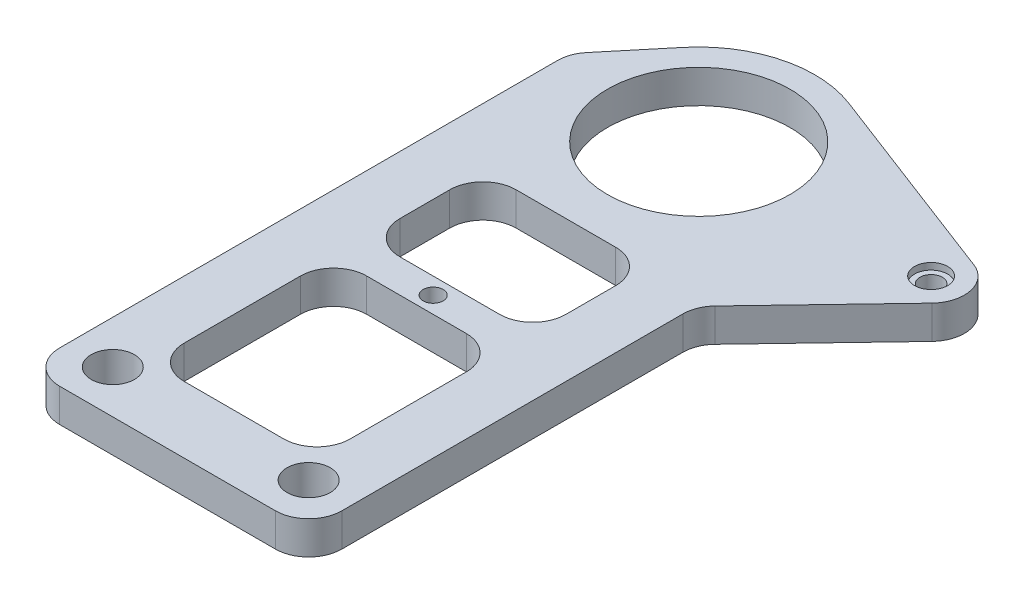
ISO-10303-21;
HEADER;
FILE_DESCRIPTION(('STEP AP214'),'2;1');
FILE_NAME('part.step','',(''),(''),'','','');
FILE_SCHEMA(('AUTOMOTIVE_DESIGN { 1 0 10303 214 1 1 1 1 }'));
ENDSEC;
DATA;
#1=APPLICATION_CONTEXT('core data for automotive mechanical design processes');
#2=APPLICATION_PROTOCOL_DEFINITION('international standard','automotive_design',2000,#1);
#3=PRODUCT_CONTEXT('',#1,'mechanical');
#4=PRODUCT('Part','Part','',(#3));
#5=PRODUCT_RELATED_PRODUCT_CATEGORY('part','',(#4));
#6=PRODUCT_DEFINITION_FORMATION('','',#4);
#7=PRODUCT_DEFINITION_CONTEXT('part definition',#1,'design');
#8=PRODUCT_DEFINITION('design','',#6,#7);
#9=PRODUCT_DEFINITION_SHAPE('','',#8);
#10=(LENGTH_UNIT() NAMED_UNIT(*) SI_UNIT(.MILLI.,.METRE.));
#11=(NAMED_UNIT(*) PLANE_ANGLE_UNIT() SI_UNIT($,.RADIAN.));
#12=(NAMED_UNIT(*) SI_UNIT($,.STERADIAN.) SOLID_ANGLE_UNIT());
#13=UNCERTAINTY_MEASURE_WITH_UNIT(LENGTH_MEASURE(1.E-05),#10,'distance_accuracy_value','');
#14=(GEOMETRIC_REPRESENTATION_CONTEXT(3) GLOBAL_UNCERTAINTY_ASSIGNED_CONTEXT((#13)) GLOBAL_UNIT_ASSIGNED_CONTEXT((#10,
#11,#12)) REPRESENTATION_CONTEXT('',''));
#15=CARTESIAN_POINT('',(0.,0.,0.));
#16=DIRECTION('',(0.,0.,1.));
#17=DIRECTION('',(1.,0.,0.));
#18=AXIS2_PLACEMENT_3D('',#15,#16,#17);
#19=CARTESIAN_POINT('',(-32.5,10.,150.));
#20=DIRECTION('',(0.,-1.,0.));
#21=DIRECTION('',(0.,0.,-1.));
#22=AXIS2_PLACEMENT_3D('',#19,#20,#21);
#23=PLANE('',#22);
#24=CARTESIAN_POINT('',(70.,10.,0.));
#25=DIRECTION('',(0.,1.,0.));
#26=DIRECTION('',(0.,0.,1.));
#27=AXIS2_PLACEMENT_3D('',#24,#25,#26);
#28=CIRCLE('',#27,5.);
#29=CARTESIAN_POINT('',(70.,10.,5.));
#30=VERTEX_POINT('',#29);
#31=EDGE_CURVE('E694',#30,#30,#28,.T.);
#32=ORIENTED_EDGE('',*,*,#31,.F.);
#33=EDGE_LOOP('',(#32));
#34=FACE_BOUND('',#33,.T.);
#35=CARTESIAN_POINT('',(29.4999999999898,10.,147.));
#36=DIRECTION('',(0.,1.,0.));
#37=DIRECTION('',(0.,0.,1.));
#38=AXIS2_PLACEMENT_3D('',#35,#36,#37);
#39=CIRCLE('',#38,6.50000000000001);
#40=CARTESIAN_POINT('',(29.4999999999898,10.,153.5));
#41=VERTEX_POINT('',#40);
#42=EDGE_CURVE('E513',#41,#41,#39,.T.);
#43=ORIENTED_EDGE('',*,*,#42,.F.);
#44=EDGE_LOOP('',(#43));
#45=FACE_BOUND('',#44,.T.);
#46=CARTESIAN_POINT('',(0.,10.,0.));
#47=DIRECTION('',(0.,1.,0.));
#48=DIRECTION('',(0.,0.,1.));
#49=AXIS2_PLACEMENT_3D('',#46,#47,#48);
#50=CIRCLE('',#49,27.5);
#51=CARTESIAN_POINT('',(0.,10.,27.5));
#52=VERTEX_POINT('',#51);
#53=EDGE_CURVE('E236',#52,#52,#50,.T.);
#54=ORIENTED_EDGE('',*,*,#53,.F.);
#55=EDGE_LOOP('',(#54));
#56=FACE_BOUND('',#55,.T.);
#57=CARTESIAN_POINT('',(-15.,10.,95.));
#58=DIRECTION('',(0.,1.,0.));
#59=DIRECTION('',(0.,0.,1.));
#60=AXIS2_PLACEMENT_3D('',#57,#58,#59);
#61=CIRCLE('',#60,9.99999999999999);
#62=CARTESIAN_POINT('',(-15.,10.,85.));
#63=VERTEX_POINT('',#62);
#64=CARTESIAN_POINT('',(-25.,10.,95.));
#65=VERTEX_POINT('',#64);
#66=EDGE_CURVE('E215',#63,#65,#61,.T.);
#67=ORIENTED_EDGE('',*,*,#66,.F.);
#68=DIRECTION('',(1.,0.,0.));
#69=VECTOR('',#68,1.);
#70=CARTESIAN_POINT('',(-15.,10.,85.));
#71=LINE('',#70,#69);
#72=CARTESIAN_POINT('',(15.,10.,85.));
#73=VERTEX_POINT('',#72);
#74=EDGE_CURVE('E273',#63,#73,#71,.T.);
#75=ORIENTED_EDGE('',*,*,#74,.T.);
#76=CARTESIAN_POINT('',(15.,10.,95.));
#77=DIRECTION('',(0.,-1.,0.));
#78=DIRECTION('',(0.,0.,-1.));
#79=AXIS2_PLACEMENT_3D('',#76,#77,#78);
#80=CIRCLE('',#79,9.99999999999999);
#81=CARTESIAN_POINT('',(25.,10.,95.));
#82=VERTEX_POINT('',#81);
#83=EDGE_CURVE('E44',#73,#82,#80,.T.);
#84=ORIENTED_EDGE('',*,*,#83,.T.);
#85=DIRECTION('',(0.,0.,-1.));
#86=VECTOR('',#85,1.);
#87=CARTESIAN_POINT('',(24.9999999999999,10.,130.));
#88=LINE('',#87,#86);
#89=CARTESIAN_POINT('',(24.9999999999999,10.,130.));
#90=VERTEX_POINT('',#89);
#91=EDGE_CURVE('E269',#90,#82,#88,.T.);
#92=ORIENTED_EDGE('',*,*,#91,.F.);
#93=CARTESIAN_POINT('',(14.9999999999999,10.,130.));
#94=DIRECTION('',(0.,1.,0.));
#95=DIRECTION('',(0.,0.,1.));
#96=AXIS2_PLACEMENT_3D('',#93,#94,#95);
#97=CIRCLE('',#96,10.);
#98=CARTESIAN_POINT('',(14.9999999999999,10.,140.));
#99=VERTEX_POINT('',#98);
#100=EDGE_CURVE('E266',#99,#90,#97,.T.);
#101=ORIENTED_EDGE('',*,*,#100,.F.);
#102=DIRECTION('',(1.,0.,0.));
#103=VECTOR('',#102,1.);
#104=CARTESIAN_POINT('',(-14.9999999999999,10.,140.));
#105=LINE('',#104,#103);
#106=CARTESIAN_POINT('',(-14.9999999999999,10.,140.));
#107=VERTEX_POINT('',#106);
#108=EDGE_CURVE('E263',#107,#99,#105,.T.);
#109=ORIENTED_EDGE('',*,*,#108,.F.);
#110=CARTESIAN_POINT('',(-14.9999999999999,10.,130.));
#111=DIRECTION('',(0.,-1.,0.));
#112=DIRECTION('',(0.,0.,-1.));
#113=AXIS2_PLACEMENT_3D('',#110,#111,#112);
#114=CIRCLE('',#113,10.);
#115=CARTESIAN_POINT('',(-24.9999999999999,10.,130.));
#116=VERTEX_POINT('',#115);
#117=EDGE_CURVE('E260',#107,#116,#114,.T.);
#118=ORIENTED_EDGE('',*,*,#117,.T.);
#119=DIRECTION('',(0.,0.,1.));
#120=VECTOR('',#119,1.);
#121=CARTESIAN_POINT('',(-25.,10.,95.));
#122=LINE('',#121,#120);
#123=EDGE_CURVE('E258',#65,#116,#122,.T.);
#124=ORIENTED_EDGE('',*,*,#123,.F.);
#125=EDGE_LOOP('',(#67,#75,#84,#92,#101,#109,#118,#124));
#126=FACE_BOUND('',#125,.T.);
#127=CARTESIAN_POINT('',(-32.5,10.,150.));
#128=DIRECTION('',(0.,-1.,0.));
#129=DIRECTION('',(0.,0.,-1.));
#130=AXIS2_PLACEMENT_3D('',#127,#128,#129);
#131=CIRCLE('',#130,10.);
#132=CARTESIAN_POINT('',(-32.5,10.,160.));
#133=VERTEX_POINT('',#132);
#134=CARTESIAN_POINT('',(-42.5,10.,150.));
#135=VERTEX_POINT('',#134);
#136=EDGE_CURVE('E389',#133,#135,#131,.T.);
#137=ORIENTED_EDGE('',*,*,#136,.F.);
#138=DIRECTION('',(-1.,0.,0.));
#139=VECTOR('',#138,1.);
#140=CARTESIAN_POINT('',(32.5,10.,160.));
#141=LINE('',#140,#139);
#142=CARTESIAN_POINT('',(32.5,10.,160.));
#143=VERTEX_POINT('',#142);
#144=EDGE_CURVE('E422',#143,#133,#141,.T.);
#145=ORIENTED_EDGE('',*,*,#144,.F.);
#146=CARTESIAN_POINT('',(32.5,10.,150.));
#147=DIRECTION('',(0.,1.,0.));
#148=DIRECTION('',(0.,0.,1.));
#149=AXIS2_PLACEMENT_3D('',#146,#147,#148);
#150=CIRCLE('',#149,10.);
#151=CARTESIAN_POINT('',(42.5,10.,150.));
#152=VERTEX_POINT('',#151);
#153=EDGE_CURVE('E419',#143,#152,#150,.T.);
#154=ORIENTED_EDGE('',*,*,#153,.T.);
#155=DIRECTION('',(0.,0.,-1.));
#156=VECTOR('',#155,1.);
#157=CARTESIAN_POINT('',(42.5,10.,150.));
#158=LINE('',#157,#156);
#159=CARTESIAN_POINT('',(42.5,10.,47.2811018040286));
#160=VERTEX_POINT('',#159);
#161=EDGE_CURVE('E416',#152,#160,#158,.T.);
#162=ORIENTED_EDGE('',*,*,#161,.T.);
#163=CARTESIAN_POINT('',(52.5,10.,47.2811018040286));
#164=DIRECTION('',(0.,-1.,0.));
#165=DIRECTION('',(0.,0.,-1.));
#166=AXIS2_PLACEMENT_3D('',#163,#164,#165);
#167=CIRCLE('',#166,10.);
#168=CARTESIAN_POINT('',(45.2682750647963,10.,40.3744271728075));
#169=VERTEX_POINT('',#168);
#170=EDGE_CURVE('E413',#160,#169,#167,.T.);
#171=ORIENTED_EDGE('',*,*,#170,.T.);
#172=DIRECTION('',(0.690667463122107,0.,-0.723172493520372));
#173=VECTOR('',#172,1.);
#174=CARTESIAN_POINT('',(45.2682750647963,10.,40.3744271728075));
#175=LINE('',#174,#173);
#176=CARTESIAN_POINT('',(77.2317249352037,10.,6.90667463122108));
#177=VERTEX_POINT('',#176);
#178=EDGE_CURVE('E410',#169,#177,#175,.T.);
#179=ORIENTED_EDGE('',*,*,#178,.T.);
#180=CARTESIAN_POINT('',(70.,10.,0.));
#181=DIRECTION('',(0.,1.,0.));
#182=DIRECTION('',(0.,0.,1.));
#183=AXIS2_PLACEMENT_3D('',#180,#181,#182);
#184=CIRCLE('',#183,10.);
#185=CARTESIAN_POINT('',(73.5714285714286,10.,-9.34049773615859));
#186=VERTEX_POINT('',#185);
#187=EDGE_CURVE('E407',#177,#186,#184,.T.);
#188=ORIENTED_EDGE('',*,*,#187,.T.);
#189=DIRECTION('',(-0.934049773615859,0.,-0.357142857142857));
#190=VECTOR('',#189,1.);
#191=CARTESIAN_POINT('',(73.5714285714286,10.,-9.34049773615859));
#192=LINE('',#191,#190);
#193=CARTESIAN_POINT('',(12.5,10.,-32.6917420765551));
#194=VERTEX_POINT('',#193);
#195=EDGE_CURVE('E404',#186,#194,#192,.T.);
#196=ORIENTED_EDGE('',*,*,#195,.T.);
#197=CARTESIAN_POINT('',(0.,10.,0.));
#198=DIRECTION('',(0.,1.,0.));
#199=DIRECTION('',(0.,0.,1.));
#200=AXIS2_PLACEMENT_3D('',#197,#198,#199);
#201=CIRCLE('',#200,35.);
#202=CARTESIAN_POINT('',(-26.9230769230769,10.,-22.363987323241));
#203=VERTEX_POINT('',#202);
#204=EDGE_CURVE('E401',#194,#203,#201,.T.);
#205=ORIENTED_EDGE('',*,*,#204,.T.);
#206=DIRECTION('',(0.638971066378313,0.,-0.769230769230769));
#207=VECTOR('',#206,1.);
#208=CARTESIAN_POINT('',(-40.1923076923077,10.,-6.38971066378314));
#209=LINE('',#208,#207);
#210=CARTESIAN_POINT('',(-40.1923076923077,10.,-6.38971066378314));
#211=VERTEX_POINT('',#210);
#212=EDGE_CURVE('E398',#211,#203,#209,.T.);
#213=ORIENTED_EDGE('',*,*,#212,.F.);
#214=CARTESIAN_POINT('',(-32.5,10.,0.));
#215=DIRECTION('',(0.,1.,0.));
#216=DIRECTION('',(0.,0.,1.));
#217=AXIS2_PLACEMENT_3D('',#214,#215,#216);
#218=CIRCLE('',#217,10.);
#219=CARTESIAN_POINT('',(-42.5,10.,0.));
#220=VERTEX_POINT('',#219);
#221=EDGE_CURVE('E395',#211,#220,#218,.T.);
#222=ORIENTED_EDGE('',*,*,#221,.T.);
#223=DIRECTION('',(0.,0.,-1.));
#224=VECTOR('',#223,1.);
#225=CARTESIAN_POINT('',(-42.5,10.,150.));
#226=LINE('',#225,#224);
#227=EDGE_CURVE('E392',#135,#220,#226,.T.);
#228=ORIENTED_EDGE('',*,*,#227,.F.);
#229=EDGE_LOOP('',(#137,#145,#154,#162,#171,#179,#188,#196,#205,#213,#222,#228));
#230=FACE_BOUND('',#229,.T.);
#231=CARTESIAN_POINT('',(15.,10.,65.));
#232=DIRECTION('',(0.,1.,0.));
#233=DIRECTION('',(0.,0.,1.));
#234=AXIS2_PLACEMENT_3D('',#231,#232,#233);
#235=CIRCLE('',#234,9.99999999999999);
#236=CARTESIAN_POINT('',(15.,10.,75.));
#237=VERTEX_POINT('',#236);
#238=CARTESIAN_POINT('',(25.,10.,65.));
#239=VERTEX_POINT('',#238);
#240=EDGE_CURVE('E312',#237,#239,#235,.T.);
#241=ORIENTED_EDGE('',*,*,#240,.F.);
#242=DIRECTION('',(1.,0.,0.));
#243=VECTOR('',#242,1.);
#244=CARTESIAN_POINT('',(-15.,10.,75.));
#245=LINE('',#244,#243);
#246=CARTESIAN_POINT('',(-15.,10.,75.));
#247=VERTEX_POINT('',#246);
#248=EDGE_CURVE('E333',#247,#237,#245,.T.);
#249=ORIENTED_EDGE('',*,*,#248,.F.);
#250=CARTESIAN_POINT('',(-15.,10.,65.));
#251=DIRECTION('',(0.,-1.,0.));
#252=DIRECTION('',(0.,0.,-1.));
#253=AXIS2_PLACEMENT_3D('',#250,#251,#252);
#254=CIRCLE('',#253,9.99999999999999);
#255=CARTESIAN_POINT('',(-25.,10.,65.));
#256=VERTEX_POINT('',#255);
#257=EDGE_CURVE('E330',#247,#256,#254,.T.);
#258=ORIENTED_EDGE('',*,*,#257,.T.);
#259=DIRECTION('',(0.,0.,-1.));
#260=VECTOR('',#259,1.);
#261=CARTESIAN_POINT('',(-25.,10.,65.));
#262=LINE('',#261,#260);
#263=CARTESIAN_POINT('',(-25.,10.,50.));
#264=VERTEX_POINT('',#263);
#265=EDGE_CURVE('E327',#256,#264,#262,.T.);
#266=ORIENTED_EDGE('',*,*,#265,.T.);
#267=CARTESIAN_POINT('',(-15.,10.,50.));
#268=DIRECTION('',(0.,-1.,0.));
#269=DIRECTION('',(0.,0.,-1.));
#270=AXIS2_PLACEMENT_3D('',#267,#268,#269);
#271=CIRCLE('',#270,10.);
#272=CARTESIAN_POINT('',(-15.,10.,40.));
#273=VERTEX_POINT('',#272);
#274=EDGE_CURVE('E324',#264,#273,#271,.T.);
#275=ORIENTED_EDGE('',*,*,#274,.T.);
#276=DIRECTION('',(-1.,0.,0.));
#277=VECTOR('',#276,1.);
#278=CARTESIAN_POINT('',(15.,10.,40.));
#279=LINE('',#278,#277);
#280=CARTESIAN_POINT('',(15.,10.,40.));
#281=VERTEX_POINT('',#280);
#282=EDGE_CURVE('E321',#281,#273,#279,.T.);
#283=ORIENTED_EDGE('',*,*,#282,.F.);
#284=CARTESIAN_POINT('',(15.,10.,50.));
#285=DIRECTION('',(0.,1.,0.));
#286=DIRECTION('',(0.,0.,1.));
#287=AXIS2_PLACEMENT_3D('',#284,#285,#286);
#288=CIRCLE('',#287,10.);
#289=CARTESIAN_POINT('',(25.,10.,50.));
#290=VERTEX_POINT('',#289);
#291=EDGE_CURVE('E318',#290,#281,#288,.T.);
#292=ORIENTED_EDGE('',*,*,#291,.F.);
#293=DIRECTION('',(0.,0.,1.));
#294=VECTOR('',#293,1.);
#295=CARTESIAN_POINT('',(25.,10.,50.));
#296=LINE('',#295,#294);
#297=EDGE_CURVE('E315',#290,#239,#296,.T.);
#298=ORIENTED_EDGE('',*,*,#297,.T.);
#299=EDGE_LOOP('',(#241,#249,#258,#266,#275,#283,#292,#298));
#300=FACE_BOUND('',#299,.T.);
#301=CARTESIAN_POINT('',(0.,10.,80.));
#302=DIRECTION('',(0.,1.,0.));
#303=DIRECTION('',(0.,0.,1.));
#304=AXIS2_PLACEMENT_3D('',#301,#302,#303);
#305=CIRCLE('',#304,3.);
#306=CARTESIAN_POINT('',(0.,10.,83.));
#307=VERTEX_POINT('',#306);
#308=EDGE_CURVE('E504',#307,#307,#305,.T.);
#309=ORIENTED_EDGE('',*,*,#308,.F.);
#310=EDGE_LOOP('',(#309));
#311=FACE_BOUND('',#310,.T.);
#312=CARTESIAN_POINT('',(-29.4999999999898,10.,147.));
#313=DIRECTION('',(0.,1.,0.));
#314=DIRECTION('',(0.,0.,1.));
#315=AXIS2_PLACEMENT_3D('',#312,#313,#314);
#316=CIRCLE('',#315,6.5);
#317=CARTESIAN_POINT('',(-29.4999999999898,10.,153.5));
#318=VERTEX_POINT('',#317);
#319=EDGE_CURVE('E507',#318,#318,#316,.T.);
#320=ORIENTED_EDGE('',*,*,#319,.F.);
#321=EDGE_LOOP('',(#320));
#322=FACE_BOUND('',#321,.T.);
#323=ADVANCED_FACE('F28',(#34,#45,#56,#126,#230,#300,#311,#322),#23,.F.);
#324=CARTESIAN_POINT('',(-32.5,0.,150.));
#325=DIRECTION('',(0.,-1.,0.));
#326=DIRECTION('',(0.,0.,-1.));
#327=AXIS2_PLACEMENT_3D('',#324,#325,#326);
#328=PLANE('',#327);
#329=CARTESIAN_POINT('',(70.,0.,0.));
#330=DIRECTION('',(0.,1.,0.));
#331=DIRECTION('',(0.,0.,1.));
#332=AXIS2_PLACEMENT_3D('',#329,#330,#331);
#333=CIRCLE('',#332,3.375);
#334=CARTESIAN_POINT('',(70.,0.,3.375));
#335=VERTEX_POINT('',#334);
#336=EDGE_CURVE('E692',#335,#335,#333,.T.);
#337=ORIENTED_EDGE('',*,*,#336,.T.);
#338=EDGE_LOOP('',(#337));
#339=FACE_BOUND('',#338,.T.);
#340=CARTESIAN_POINT('',(29.4999999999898,0.,147.));
#341=DIRECTION('',(0.,1.,0.));
#342=DIRECTION('',(0.,0.,1.));
#343=AXIS2_PLACEMENT_3D('',#340,#341,#342);
#344=CIRCLE('',#343,6.50000000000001);
#345=CARTESIAN_POINT('',(29.4999999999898,0.,153.5));
#346=VERTEX_POINT('',#345);
#347=EDGE_CURVE('E509',#346,#346,#344,.T.);
#348=ORIENTED_EDGE('',*,*,#347,.T.);
#349=EDGE_LOOP('',(#348));
#350=FACE_BOUND('',#349,.T.);
#351=CARTESIAN_POINT('',(0.,0.,0.));
#352=DIRECTION('',(0.,1.,0.));
#353=DIRECTION('',(0.,0.,1.));
#354=AXIS2_PLACEMENT_3D('',#351,#352,#353);
#355=CIRCLE('',#354,27.5);
#356=CARTESIAN_POINT('',(0.,0.,27.5));
#357=VERTEX_POINT('',#356);
#358=EDGE_CURVE('E239',#357,#357,#355,.T.);
#359=ORIENTED_EDGE('',*,*,#358,.T.);
#360=EDGE_LOOP('',(#359));
#361=FACE_BOUND('',#360,.T.);
#362=DIRECTION('',(1.,0.,0.));
#363=VECTOR('',#362,1.);
#364=CARTESIAN_POINT('',(-15.,0.,85.));
#365=LINE('',#364,#363);
#366=CARTESIAN_POINT('',(-15.,0.,85.));
#367=VERTEX_POINT('',#366);
#368=CARTESIAN_POINT('',(15.,0.,85.));
#369=VERTEX_POINT('',#368);
#370=EDGE_CURVE('E235',#367,#369,#365,.T.);
#371=ORIENTED_EDGE('',*,*,#370,.F.);
#372=CARTESIAN_POINT('',(-15.,0.,95.));
#373=DIRECTION('',(0.,1.,0.));
#374=DIRECTION('',(0.,0.,1.));
#375=AXIS2_PLACEMENT_3D('',#372,#373,#374);
#376=CIRCLE('',#375,9.99999999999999);
#377=CARTESIAN_POINT('',(-25.,0.,95.));
#378=VERTEX_POINT('',#377);
#379=EDGE_CURVE('E52',#367,#378,#376,.T.);
#380=ORIENTED_EDGE('',*,*,#379,.T.);
#381=DIRECTION('',(0.,0.,1.));
#382=VECTOR('',#381,1.);
#383=CARTESIAN_POINT('',(-25.,0.,95.));
#384=LINE('',#383,#382);
#385=CARTESIAN_POINT('',(-24.9999999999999,0.,130.));
#386=VERTEX_POINT('',#385);
#387=EDGE_CURVE('E223',#378,#386,#384,.T.);
#388=ORIENTED_EDGE('',*,*,#387,.T.);
#389=CARTESIAN_POINT('',(-14.9999999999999,0.,130.));
#390=DIRECTION('',(0.,-1.,0.));
#391=DIRECTION('',(0.,0.,-1.));
#392=AXIS2_PLACEMENT_3D('',#389,#390,#391);
#393=CIRCLE('',#392,10.);
#394=CARTESIAN_POINT('',(-14.9999999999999,0.,140.));
#395=VERTEX_POINT('',#394);
#396=EDGE_CURVE('E228',#395,#386,#393,.T.);
#397=ORIENTED_EDGE('',*,*,#396,.F.);
#398=DIRECTION('',(1.,0.,0.));
#399=VECTOR('',#398,1.);
#400=CARTESIAN_POINT('',(-14.9999999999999,0.,140.));
#401=LINE('',#400,#399);
#402=CARTESIAN_POINT('',(14.9999999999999,0.,140.));
#403=VERTEX_POINT('',#402);
#404=EDGE_CURVE('E244',#395,#403,#401,.T.);
#405=ORIENTED_EDGE('',*,*,#404,.T.);
#406=CARTESIAN_POINT('',(14.9999999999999,0.,130.));
#407=DIRECTION('',(0.,1.,0.));
#408=DIRECTION('',(0.,0.,1.));
#409=AXIS2_PLACEMENT_3D('',#406,#407,#408);
#410=CIRCLE('',#409,10.);
#411=CARTESIAN_POINT('',(24.9999999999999,0.,130.));
#412=VERTEX_POINT('',#411);
#413=EDGE_CURVE('E247',#403,#412,#410,.T.);
#414=ORIENTED_EDGE('',*,*,#413,.T.);
#415=DIRECTION('',(0.,0.,-1.));
#416=VECTOR('',#415,1.);
#417=CARTESIAN_POINT('',(24.9999999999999,0.,130.));
#418=LINE('',#417,#416);
#419=CARTESIAN_POINT('',(25.,0.,95.));
#420=VERTEX_POINT('',#419);
#421=EDGE_CURVE('E250',#412,#420,#418,.T.);
#422=ORIENTED_EDGE('',*,*,#421,.T.);
#423=CARTESIAN_POINT('',(15.,0.,95.));
#424=DIRECTION('',(0.,-1.,0.));
#425=DIRECTION('',(0.,0.,-1.));
#426=AXIS2_PLACEMENT_3D('',#423,#424,#425);
#427=CIRCLE('',#426,9.99999999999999);
#428=EDGE_CURVE('E253',#369,#420,#427,.T.);
#429=ORIENTED_EDGE('',*,*,#428,.F.);
#430=EDGE_LOOP('',(#371,#380,#388,#397,#405,#414,#422,#429));
#431=FACE_BOUND('',#430,.T.);
#432=CARTESIAN_POINT('',(-32.5,0.,150.));
#433=DIRECTION('',(0.,-1.,0.));
#434=DIRECTION('',(0.,0.,-1.));
#435=AXIS2_PLACEMENT_3D('',#432,#433,#434);
#436=CIRCLE('',#435,10.);
#437=CARTESIAN_POINT('',(-32.5,0.,160.));
#438=VERTEX_POINT('',#437);
#439=CARTESIAN_POINT('',(-42.5,0.,150.));
#440=VERTEX_POINT('',#439);
#441=EDGE_CURVE('E353',#438,#440,#436,.T.);
#442=ORIENTED_EDGE('',*,*,#441,.T.);
#443=DIRECTION('',(0.,0.,-1.));
#444=VECTOR('',#443,1.);
#445=CARTESIAN_POINT('',(-42.5,0.,150.));
#446=LINE('',#445,#444);
#447=CARTESIAN_POINT('',(-42.5,0.,0.));
#448=VERTEX_POINT('',#447);
#449=EDGE_CURVE('E356',#440,#448,#446,.T.);
#450=ORIENTED_EDGE('',*,*,#449,.T.);
#451=CARTESIAN_POINT('',(-32.5,0.,0.));
#452=DIRECTION('',(0.,1.,0.));
#453=DIRECTION('',(0.,0.,1.));
#454=AXIS2_PLACEMENT_3D('',#451,#452,#453);
#455=CIRCLE('',#454,10.);
#456=CARTESIAN_POINT('',(-40.1923076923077,0.,-6.38971066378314));
#457=VERTEX_POINT('',#456);
#458=EDGE_CURVE('E359',#457,#448,#455,.T.);
#459=ORIENTED_EDGE('',*,*,#458,.F.);
#460=DIRECTION('',(0.638971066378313,0.,-0.769230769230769));
#461=VECTOR('',#460,1.);
#462=CARTESIAN_POINT('',(-40.1923076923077,0.,-6.38971066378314));
#463=LINE('',#462,#461);
#464=CARTESIAN_POINT('',(-26.9230769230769,0.,-22.363987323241));
#465=VERTEX_POINT('',#464);
#466=EDGE_CURVE('E362',#457,#465,#463,.T.);
#467=ORIENTED_EDGE('',*,*,#466,.T.);
#468=CARTESIAN_POINT('',(0.,0.,0.));
#469=DIRECTION('',(0.,1.,0.));
#470=DIRECTION('',(0.,0.,1.));
#471=AXIS2_PLACEMENT_3D('',#468,#469,#470);
#472=CIRCLE('',#471,35.);
#473=CARTESIAN_POINT('',(12.5,0.,-32.6917420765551));
#474=VERTEX_POINT('',#473);
#475=EDGE_CURVE('E365',#474,#465,#472,.T.);
#476=ORIENTED_EDGE('',*,*,#475,.F.);
#477=DIRECTION('',(-0.934049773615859,0.,-0.357142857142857));
#478=VECTOR('',#477,1.);
#479=CARTESIAN_POINT('',(73.5714285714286,0.,-9.34049773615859));
#480=LINE('',#479,#478);
#481=CARTESIAN_POINT('',(73.5714285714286,0.,-9.34049773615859));
#482=VERTEX_POINT('',#481);
#483=EDGE_CURVE('E368',#482,#474,#480,.T.);
#484=ORIENTED_EDGE('',*,*,#483,.F.);
#485=CARTESIAN_POINT('',(70.,0.,0.));
#486=DIRECTION('',(0.,1.,0.));
#487=DIRECTION('',(0.,0.,1.));
#488=AXIS2_PLACEMENT_3D('',#485,#486,#487);
#489=CIRCLE('',#488,10.);
#490=CARTESIAN_POINT('',(77.2317249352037,0.,6.90667463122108));
#491=VERTEX_POINT('',#490);
#492=EDGE_CURVE('E371',#491,#482,#489,.T.);
#493=ORIENTED_EDGE('',*,*,#492,.F.);
#494=DIRECTION('',(0.690667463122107,0.,-0.723172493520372));
#495=VECTOR('',#494,1.);
#496=CARTESIAN_POINT('',(45.2682750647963,0.,40.3744271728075));
#497=LINE('',#496,#495);
#498=CARTESIAN_POINT('',(45.2682750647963,0.,40.3744271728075));
#499=VERTEX_POINT('',#498);
#500=EDGE_CURVE('E374',#499,#491,#497,.T.);
#501=ORIENTED_EDGE('',*,*,#500,.F.);
#502=CARTESIAN_POINT('',(52.5,0.,47.2811018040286));
#503=DIRECTION('',(0.,-1.,0.));
#504=DIRECTION('',(0.,0.,-1.));
#505=AXIS2_PLACEMENT_3D('',#502,#503,#504);
#506=CIRCLE('',#505,10.);
#507=CARTESIAN_POINT('',(42.5,0.,47.2811018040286));
#508=VERTEX_POINT('',#507);
#509=EDGE_CURVE('E377',#508,#499,#506,.T.);
#510=ORIENTED_EDGE('',*,*,#509,.F.);
#511=DIRECTION('',(0.,0.,-1.));
#512=VECTOR('',#511,1.);
#513=CARTESIAN_POINT('',(42.5,0.,150.));
#514=LINE('',#513,#512);
#515=CARTESIAN_POINT('',(42.5,0.,150.));
#516=VERTEX_POINT('',#515);
#517=EDGE_CURVE('E380',#516,#508,#514,.T.);
#518=ORIENTED_EDGE('',*,*,#517,.F.);
#519=CARTESIAN_POINT('',(32.5,0.,150.));
#520=DIRECTION('',(0.,1.,0.));
#521=DIRECTION('',(0.,0.,1.));
#522=AXIS2_PLACEMENT_3D('',#519,#520,#521);
#523=CIRCLE('',#522,10.);
#524=CARTESIAN_POINT('',(32.5,0.,160.));
#525=VERTEX_POINT('',#524);
#526=EDGE_CURVE('E383',#525,#516,#523,.T.);
#527=ORIENTED_EDGE('',*,*,#526,.F.);
#528=DIRECTION('',(-1.,0.,0.));
#529=VECTOR('',#528,1.);
#530=CARTESIAN_POINT('',(32.5,0.,160.));
#531=LINE('',#530,#529);
#532=EDGE_CURVE('E386',#525,#438,#531,.T.);
#533=ORIENTED_EDGE('',*,*,#532,.T.);
#534=EDGE_LOOP('',(#442,#450,#459,#467,#476,#484,#493,#501,#510,#518,#527,#533));
#535=FACE_BOUND('',#534,.T.);
#536=DIRECTION('',(1.,0.,0.));
#537=VECTOR('',#536,1.);
#538=CARTESIAN_POINT('',(-15.,0.,75.));
#539=LINE('',#538,#537);
#540=CARTESIAN_POINT('',(-15.,0.,75.));
#541=VERTEX_POINT('',#540);
#542=CARTESIAN_POINT('',(15.,0.,75.));
#543=VERTEX_POINT('',#542);
#544=EDGE_CURVE('E309',#541,#543,#539,.T.);
#545=ORIENTED_EDGE('',*,*,#544,.T.);
#546=CARTESIAN_POINT('',(15.,0.,65.));
#547=DIRECTION('',(0.,1.,0.));
#548=DIRECTION('',(0.,0.,1.));
#549=AXIS2_PLACEMENT_3D('',#546,#547,#548);
#550=CIRCLE('',#549,9.99999999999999);
#551=CARTESIAN_POINT('',(25.,0.,65.));
#552=VERTEX_POINT('',#551);
#553=EDGE_CURVE('E219',#543,#552,#550,.T.);
#554=ORIENTED_EDGE('',*,*,#553,.T.);
#555=DIRECTION('',(0.,0.,1.));
#556=VECTOR('',#555,1.);
#557=CARTESIAN_POINT('',(25.,0.,50.));
#558=LINE('',#557,#556);
#559=CARTESIAN_POINT('',(25.,0.,50.));
#560=VERTEX_POINT('',#559);
#561=EDGE_CURVE('E291',#560,#552,#558,.T.);
#562=ORIENTED_EDGE('',*,*,#561,.F.);
#563=CARTESIAN_POINT('',(15.,0.,50.));
#564=DIRECTION('',(0.,1.,0.));
#565=DIRECTION('',(0.,0.,1.));
#566=AXIS2_PLACEMENT_3D('',#563,#564,#565);
#567=CIRCLE('',#566,10.);
#568=CARTESIAN_POINT('',(15.,0.,40.));
#569=VERTEX_POINT('',#568);
#570=EDGE_CURVE('E294',#560,#569,#567,.T.);
#571=ORIENTED_EDGE('',*,*,#570,.T.);
#572=DIRECTION('',(-1.,0.,0.));
#573=VECTOR('',#572,1.);
#574=CARTESIAN_POINT('',(15.,0.,40.));
#575=LINE('',#574,#573);
#576=CARTESIAN_POINT('',(-15.,0.,40.));
#577=VERTEX_POINT('',#576);
#578=EDGE_CURVE('E297',#569,#577,#575,.T.);
#579=ORIENTED_EDGE('',*,*,#578,.T.);
#580=CARTESIAN_POINT('',(-15.,0.,50.));
#581=DIRECTION('',(0.,-1.,0.));
#582=DIRECTION('',(0.,0.,-1.));
#583=AXIS2_PLACEMENT_3D('',#580,#581,#582);
#584=CIRCLE('',#583,10.);
#585=CARTESIAN_POINT('',(-25.,0.,50.));
#586=VERTEX_POINT('',#585);
#587=EDGE_CURVE('E300',#586,#577,#584,.T.);
#588=ORIENTED_EDGE('',*,*,#587,.F.);
#589=DIRECTION('',(0.,0.,-1.));
#590=VECTOR('',#589,1.);
#591=CARTESIAN_POINT('',(-25.,0.,65.));
#592=LINE('',#591,#590);
#593=CARTESIAN_POINT('',(-25.,0.,65.));
#594=VERTEX_POINT('',#593);
#595=EDGE_CURVE('E303',#594,#586,#592,.T.);
#596=ORIENTED_EDGE('',*,*,#595,.F.);
#597=CARTESIAN_POINT('',(-15.,0.,65.));
#598=DIRECTION('',(0.,-1.,0.));
#599=DIRECTION('',(0.,0.,-1.));
#600=AXIS2_PLACEMENT_3D('',#597,#598,#599);
#601=CIRCLE('',#600,9.99999999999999);
#602=EDGE_CURVE('E306',#541,#594,#601,.T.);
#603=ORIENTED_EDGE('',*,*,#602,.F.);
#604=EDGE_LOOP('',(#545,#554,#562,#571,#579,#588,#596,#603));
#605=FACE_BOUND('',#604,.T.);
#606=CARTESIAN_POINT('',(0.,0.,80.));
#607=DIRECTION('',(0.,1.,0.));
#608=DIRECTION('',(0.,0.,1.));
#609=AXIS2_PLACEMENT_3D('',#606,#607,#608);
#610=CIRCLE('',#609,3.);
#611=CARTESIAN_POINT('',(0.,0.,83.));
#612=VERTEX_POINT('',#611);
#613=EDGE_CURVE('E522',#612,#612,#610,.T.);
#614=ORIENTED_EDGE('',*,*,#613,.T.);
#615=EDGE_LOOP('',(#614));
#616=FACE_BOUND('',#615,.T.);
#617=CARTESIAN_POINT('',(-29.4999999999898,0.,147.));
#618=DIRECTION('',(0.,1.,0.));
#619=DIRECTION('',(0.,0.,1.));
#620=AXIS2_PLACEMENT_3D('',#617,#618,#619);
#621=CIRCLE('',#620,6.5);
#622=CARTESIAN_POINT('',(-29.4999999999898,0.,153.5));
#623=VERTEX_POINT('',#622);
#624=EDGE_CURVE('E510',#623,#623,#621,.T.);
#625=ORIENTED_EDGE('',*,*,#624,.T.);
#626=EDGE_LOOP('',(#625));
#627=FACE_BOUND('',#626,.T.);
#628=ADVANCED_FACE('F231',(#339,#350,#361,#431,#535,#605,#616,#627),#328,.T.);
#629=CARTESIAN_POINT('',(-32.5,10.,150.));
#630=DIRECTION('',(0.,-1.,0.));
#631=DIRECTION('',(0.,0.,-1.));
#632=AXIS2_PLACEMENT_3D('',#629,#630,#631);
#633=CYLINDRICAL_SURFACE('',#632,10.);
#634=DIRECTION('',(0.,-1.,0.));
#635=VECTOR('',#634,1.);
#636=CARTESIAN_POINT('',(-32.5,10.,160.));
#637=LINE('',#636,#635);
#638=EDGE_CURVE('E11',#133,#438,#637,.T.);
#639=ORIENTED_EDGE('',*,*,#638,.F.);
#640=ORIENTED_EDGE('',*,*,#136,.T.);
#641=DIRECTION('',(0.,-1.,0.));
#642=VECTOR('',#641,1.);
#643=CARTESIAN_POINT('',(-42.5,10.,150.));
#644=LINE('',#643,#642);
#645=EDGE_CURVE('E425',#135,#440,#644,.T.);
#646=ORIENTED_EDGE('',*,*,#645,.T.);
#647=ORIENTED_EDGE('',*,*,#441,.F.);
#648=EDGE_LOOP('',(#639,#640,#646,#647));
#649=FACE_BOUND('',#648,.T.);
#650=ADVANCED_FACE('F458',(#649),#633,.T.);
#651=CARTESIAN_POINT('',(32.5,10.,160.));
#652=DIRECTION('',(0.,0.,1.));
#653=DIRECTION('',(1.,0.,0.));
#654=AXIS2_PLACEMENT_3D('',#651,#652,#653);
#655=PLANE('',#654);
#656=DIRECTION('',(0.,-1.,0.));
#657=VECTOR('',#656,1.);
#658=CARTESIAN_POINT('',(32.5,10.,160.));
#659=LINE('',#658,#657);
#660=EDGE_CURVE('E37',#143,#525,#659,.T.);
#661=ORIENTED_EDGE('',*,*,#660,.F.);
#662=ORIENTED_EDGE('',*,*,#144,.T.);
#663=ORIENTED_EDGE('',*,*,#638,.T.);
#664=ORIENTED_EDGE('',*,*,#532,.F.);
#665=EDGE_LOOP('',(#661,#662,#663,#664));
#666=FACE_BOUND('',#665,.T.);
#667=ADVANCED_FACE('F30',(#666),#655,.T.);
#668=CARTESIAN_POINT('',(32.5,10.,150.));
#669=DIRECTION('',(0.,-1.,0.));
#670=DIRECTION('',(0.,0.,-1.));
#671=AXIS2_PLACEMENT_3D('',#668,#669,#670);
#672=CYLINDRICAL_SURFACE('',#671,10.);
#673=DIRECTION('',(0.,-1.,0.));
#674=VECTOR('',#673,1.);
#675=CARTESIAN_POINT('',(42.5,10.,150.));
#676=LINE('',#675,#674);
#677=EDGE_CURVE('E443',#152,#516,#676,.T.);
#678=ORIENTED_EDGE('',*,*,#677,.F.);
#679=ORIENTED_EDGE('',*,*,#153,.F.);
#680=ORIENTED_EDGE('',*,*,#660,.T.);
#681=ORIENTED_EDGE('',*,*,#526,.T.);
#682=EDGE_LOOP('',(#678,#679,#680,#681));
#683=FACE_BOUND('',#682,.T.);
#684=ADVANCED_FACE('F448',(#683),#672,.T.);
#685=CARTESIAN_POINT('',(42.5,10.,150.));
#686=DIRECTION('',(-1.,0.,0.));
#687=DIRECTION('',(0.,0.,1.));
#688=AXIS2_PLACEMENT_3D('',#685,#686,#687);
#689=PLANE('',#688);
#690=DIRECTION('',(0.,-1.,0.));
#691=VECTOR('',#690,1.);
#692=CARTESIAN_POINT('',(42.5,10.,47.2811018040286));
#693=LINE('',#692,#691);
#694=EDGE_CURVE('E441',#160,#508,#693,.T.);
#695=ORIENTED_EDGE('',*,*,#694,.F.);
#696=ORIENTED_EDGE('',*,*,#161,.F.);
#697=ORIENTED_EDGE('',*,*,#677,.T.);
#698=ORIENTED_EDGE('',*,*,#517,.T.);
#699=EDGE_LOOP('',(#695,#696,#697,#698));
#700=FACE_BOUND('',#699,.T.);
#701=ADVANCED_FACE('F491',(#700),#689,.F.);
#702=CARTESIAN_POINT('',(52.5,10.,47.2811018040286));
#703=DIRECTION('',(0.,-1.,0.));
#704=DIRECTION('',(0.,0.,-1.));
#705=AXIS2_PLACEMENT_3D('',#702,#703,#704);
#706=CYLINDRICAL_SURFACE('',#705,10.);
#707=DIRECTION('',(0.,-1.,0.));
#708=VECTOR('',#707,1.);
#709=CARTESIAN_POINT('',(45.2682750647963,10.,40.3744271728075));
#710=LINE('',#709,#708);
#711=EDGE_CURVE('E439',#169,#499,#710,.T.);
#712=ORIENTED_EDGE('',*,*,#711,.F.);
#713=ORIENTED_EDGE('',*,*,#170,.F.);
#714=ORIENTED_EDGE('',*,*,#694,.T.);
#715=ORIENTED_EDGE('',*,*,#509,.T.);
#716=EDGE_LOOP('',(#712,#713,#714,#715));
#717=FACE_BOUND('',#716,.T.);
#718=ADVANCED_FACE('F489',(#717),#706,.F.);
#719=CARTESIAN_POINT('',(45.2682750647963,10.,40.3744271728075));
#720=DIRECTION('',(-0.723172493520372,0.,-0.690667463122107));
#721=DIRECTION('',(-0.690667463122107,0.,0.723172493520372));
#722=AXIS2_PLACEMENT_3D('',#719,#720,#721);
#723=PLANE('',#722);
#724=DIRECTION('',(0.,-1.,0.));
#725=VECTOR('',#724,1.);
#726=CARTESIAN_POINT('',(77.2317249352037,10.,6.90667463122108));
#727=LINE('',#726,#725);
#728=EDGE_CURVE('E437',#177,#491,#727,.T.);
#729=ORIENTED_EDGE('',*,*,#728,.F.);
#730=ORIENTED_EDGE('',*,*,#178,.F.);
#731=ORIENTED_EDGE('',*,*,#711,.T.);
#732=ORIENTED_EDGE('',*,*,#500,.T.);
#733=EDGE_LOOP('',(#729,#730,#731,#732));
#734=FACE_BOUND('',#733,.T.);
#735=ADVANCED_FACE('F485',(#734),#723,.F.);
#736=CARTESIAN_POINT('',(70.,10.,0.));
#737=DIRECTION('',(0.,-1.,0.));
#738=DIRECTION('',(0.,0.,-1.));
#739=AXIS2_PLACEMENT_3D('',#736,#737,#738);
#740=CYLINDRICAL_SURFACE('',#739,10.);
#741=DIRECTION('',(0.,-1.,0.));
#742=VECTOR('',#741,1.);
#743=CARTESIAN_POINT('',(73.5714285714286,10.,-9.34049773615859));
#744=LINE('',#743,#742);
#745=EDGE_CURVE('E435',#186,#482,#744,.T.);
#746=ORIENTED_EDGE('',*,*,#745,.F.);
#747=ORIENTED_EDGE('',*,*,#187,.F.);
#748=ORIENTED_EDGE('',*,*,#728,.T.);
#749=ORIENTED_EDGE('',*,*,#492,.T.);
#750=EDGE_LOOP('',(#746,#747,#748,#749));
#751=FACE_BOUND('',#750,.T.);
#752=ADVANCED_FACE('F482',(#751),#740,.T.);
#753=CARTESIAN_POINT('',(73.5714285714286,10.,-9.34049773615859));
#754=DIRECTION('',(-0.357142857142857,0.,0.934049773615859));
#755=DIRECTION('',(0.934049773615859,0.,0.357142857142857));
#756=AXIS2_PLACEMENT_3D('',#753,#754,#755);
#757=PLANE('',#756);
#758=DIRECTION('',(0.,-1.,0.));
#759=VECTOR('',#758,1.);
#760=CARTESIAN_POINT('',(12.5,10.,-32.6917420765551));
#761=LINE('',#760,#759);
#762=EDGE_CURVE('E433',#194,#474,#761,.T.);
#763=ORIENTED_EDGE('',*,*,#762,.F.);
#764=ORIENTED_EDGE('',*,*,#195,.F.);
#765=ORIENTED_EDGE('',*,*,#745,.T.);
#766=ORIENTED_EDGE('',*,*,#483,.T.);
#767=EDGE_LOOP('',(#763,#764,#765,#766));
#768=FACE_BOUND('',#767,.T.);
#769=ADVANCED_FACE('F478',(#768),#757,.F.);
#770=CARTESIAN_POINT('',(0.,10.,0.));
#771=DIRECTION('',(0.,-1.,0.));
#772=DIRECTION('',(0.,0.,-1.));
#773=AXIS2_PLACEMENT_3D('',#770,#771,#772);
#774=CYLINDRICAL_SURFACE('',#773,35.);
#775=DIRECTION('',(0.,-1.,0.));
#776=VECTOR('',#775,1.);
#777=CARTESIAN_POINT('',(-26.9230769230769,10.,-22.363987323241));
#778=LINE('',#777,#776);
#779=EDGE_CURVE('E431',#203,#465,#778,.T.);
#780=ORIENTED_EDGE('',*,*,#779,.F.);
#781=ORIENTED_EDGE('',*,*,#204,.F.);
#782=ORIENTED_EDGE('',*,*,#762,.T.);
#783=ORIENTED_EDGE('',*,*,#475,.T.);
#784=EDGE_LOOP('',(#780,#781,#782,#783));
#785=FACE_BOUND('',#784,.T.);
#786=ADVANCED_FACE('F474',(#785),#774,.T.);
#787=CARTESIAN_POINT('',(-40.1923076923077,10.,-6.38971066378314));
#788=DIRECTION('',(-0.769230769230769,0.,-0.638971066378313));
#789=DIRECTION('',(-0.638971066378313,0.,0.769230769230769));
#790=AXIS2_PLACEMENT_3D('',#787,#788,#789);
#791=PLANE('',#790);
#792=DIRECTION('',(0.,-1.,0.));
#793=VECTOR('',#792,1.);
#794=CARTESIAN_POINT('',(-40.1923076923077,10.,-6.38971066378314));
#795=LINE('',#794,#793);
#796=EDGE_CURVE('E429',#211,#457,#795,.T.);
#797=ORIENTED_EDGE('',*,*,#796,.F.);
#798=ORIENTED_EDGE('',*,*,#212,.T.);
#799=ORIENTED_EDGE('',*,*,#779,.T.);
#800=ORIENTED_EDGE('',*,*,#466,.F.);
#801=EDGE_LOOP('',(#797,#798,#799,#800));
#802=FACE_BOUND('',#801,.T.);
#803=ADVANCED_FACE('F471',(#802),#791,.T.);
#804=CARTESIAN_POINT('',(-32.5,10.,0.));
#805=DIRECTION('',(0.,-1.,0.));
#806=DIRECTION('',(0.,0.,-1.));
#807=AXIS2_PLACEMENT_3D('',#804,#805,#806);
#808=CYLINDRICAL_SURFACE('',#807,10.);
#809=DIRECTION('',(0.,-1.,0.));
#810=VECTOR('',#809,1.);
#811=CARTESIAN_POINT('',(-42.5,10.,0.));
#812=LINE('',#811,#810);
#813=EDGE_CURVE('E427',#220,#448,#812,.T.);
#814=ORIENTED_EDGE('',*,*,#813,.F.);
#815=ORIENTED_EDGE('',*,*,#221,.F.);
#816=ORIENTED_EDGE('',*,*,#796,.T.);
#817=ORIENTED_EDGE('',*,*,#458,.T.);
#818=EDGE_LOOP('',(#814,#815,#816,#817));
#819=FACE_BOUND('',#818,.T.);
#820=ADVANCED_FACE('F466',(#819),#808,.T.);
#821=CARTESIAN_POINT('',(-42.5,10.,150.));
#822=DIRECTION('',(-1.,0.,0.));
#823=DIRECTION('',(0.,0.,1.));
#824=AXIS2_PLACEMENT_3D('',#821,#822,#823);
#825=PLANE('',#824);
#826=ORIENTED_EDGE('',*,*,#227,.T.);
#827=ORIENTED_EDGE('',*,*,#813,.T.);
#828=ORIENTED_EDGE('',*,*,#449,.F.);
#829=ORIENTED_EDGE('',*,*,#645,.F.);
#830=EDGE_LOOP('',(#826,#827,#828,#829));
#831=FACE_BOUND('',#830,.T.);
#832=ADVANCED_FACE('F462',(#831),#825,.T.);
#833=CARTESIAN_POINT('',(15.,10.,65.));
#834=DIRECTION('',(0.,-1.,0.));
#835=DIRECTION('',(0.,0.,-1.));
#836=AXIS2_PLACEMENT_3D('',#833,#834,#835);
#837=CYLINDRICAL_SURFACE('',#836,9.99999999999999);
#838=DIRECTION('',(0.,-1.,0.));
#839=VECTOR('',#838,1.);
#840=CARTESIAN_POINT('',(25.,10.,65.));
#841=LINE('',#840,#839);
#842=EDGE_CURVE('E351',#239,#552,#841,.T.);
#843=ORIENTED_EDGE('',*,*,#842,.T.);
#844=ORIENTED_EDGE('',*,*,#553,.F.);
#845=DIRECTION('',(0.,-1.,0.));
#846=VECTOR('',#845,1.);
#847=CARTESIAN_POINT('',(15.,10.,75.));
#848=LINE('',#847,#846);
#849=EDGE_CURVE('E336',#237,#543,#848,.T.);
#850=ORIENTED_EDGE('',*,*,#849,.F.);
#851=ORIENTED_EDGE('',*,*,#240,.T.);
#852=EDGE_LOOP('',(#843,#844,#850,#851));
#853=FACE_BOUND('',#852,.T.);
#854=ADVANCED_FACE('F570',(#853),#837,.F.);
#855=CARTESIAN_POINT('',(25.,10.,50.));
#856=DIRECTION('',(1.,0.,0.));
#857=DIRECTION('',(0.,0.,-1.));
#858=AXIS2_PLACEMENT_3D('',#855,#856,#857);
#859=PLANE('',#858);
#860=DIRECTION('',(0.,-1.,0.));
#861=VECTOR('',#860,1.);
#862=CARTESIAN_POINT('',(25.,10.,50.));
#863=LINE('',#862,#861);
#864=EDGE_CURVE('E349',#290,#560,#863,.T.);
#865=ORIENTED_EDGE('',*,*,#864,.T.);
#866=ORIENTED_EDGE('',*,*,#561,.T.);
#867=ORIENTED_EDGE('',*,*,#842,.F.);
#868=ORIENTED_EDGE('',*,*,#297,.F.);
#869=EDGE_LOOP('',(#865,#866,#867,#868));
#870=FACE_BOUND('',#869,.T.);
#871=ADVANCED_FACE('F573',(#870),#859,.F.);
#872=CARTESIAN_POINT('',(15.,10.,50.));
#873=DIRECTION('',(0.,-1.,0.));
#874=DIRECTION('',(0.,0.,-1.));
#875=AXIS2_PLACEMENT_3D('',#872,#873,#874);
#876=CYLINDRICAL_SURFACE('',#875,10.);
#877=DIRECTION('',(0.,-1.,0.));
#878=VECTOR('',#877,1.);
#879=CARTESIAN_POINT('',(15.,10.,40.));
#880=LINE('',#879,#878);
#881=EDGE_CURVE('E347',#281,#569,#880,.T.);
#882=ORIENTED_EDGE('',*,*,#881,.T.);
#883=ORIENTED_EDGE('',*,*,#570,.F.);
#884=ORIENTED_EDGE('',*,*,#864,.F.);
#885=ORIENTED_EDGE('',*,*,#291,.T.);
#886=EDGE_LOOP('',(#882,#883,#884,#885));
#887=FACE_BOUND('',#886,.T.);
#888=ADVANCED_FACE('F593',(#887),#876,.F.);
#889=CARTESIAN_POINT('',(15.,10.,40.));
#890=DIRECTION('',(0.,0.,1.));
#891=DIRECTION('',(1.,0.,0.));
#892=AXIS2_PLACEMENT_3D('',#889,#890,#891);
#893=PLANE('',#892);
#894=DIRECTION('',(0.,-1.,0.));
#895=VECTOR('',#894,1.);
#896=CARTESIAN_POINT('',(-15.,10.,40.));
#897=LINE('',#896,#895);
#898=EDGE_CURVE('E345',#273,#577,#897,.T.);
#899=ORIENTED_EDGE('',*,*,#898,.T.);
#900=ORIENTED_EDGE('',*,*,#578,.F.);
#901=ORIENTED_EDGE('',*,*,#881,.F.);
#902=ORIENTED_EDGE('',*,*,#282,.T.);
#903=EDGE_LOOP('',(#899,#900,#901,#902));
#904=FACE_BOUND('',#903,.T.);
#905=ADVANCED_FACE('F589',(#904),#893,.T.);
#906=CARTESIAN_POINT('',(-15.,10.,50.));
#907=DIRECTION('',(0.,-1.,0.));
#908=DIRECTION('',(0.,0.,-1.));
#909=AXIS2_PLACEMENT_3D('',#906,#907,#908);
#910=CYLINDRICAL_SURFACE('',#909,10.);
#911=DIRECTION('',(0.,-1.,0.));
#912=VECTOR('',#911,1.);
#913=CARTESIAN_POINT('',(-25.,10.,50.));
#914=LINE('',#913,#912);
#915=EDGE_CURVE('E343',#264,#586,#914,.T.);
#916=ORIENTED_EDGE('',*,*,#915,.T.);
#917=ORIENTED_EDGE('',*,*,#587,.T.);
#918=ORIENTED_EDGE('',*,*,#898,.F.);
#919=ORIENTED_EDGE('',*,*,#274,.F.);
#920=EDGE_LOOP('',(#916,#917,#918,#919));
#921=FACE_BOUND('',#920,.T.);
#922=ADVANCED_FACE('F585',(#921),#910,.F.);
#923=CARTESIAN_POINT('',(-25.,10.,65.));
#924=DIRECTION('',(-1.,0.,0.));
#925=DIRECTION('',(0.,0.,1.));
#926=AXIS2_PLACEMENT_3D('',#923,#924,#925);
#927=PLANE('',#926);
#928=DIRECTION('',(0.,-1.,0.));
#929=VECTOR('',#928,1.);
#930=CARTESIAN_POINT('',(-25.,10.,65.));
#931=LINE('',#930,#929);
#932=EDGE_CURVE('E341',#256,#594,#931,.T.);
#933=ORIENTED_EDGE('',*,*,#932,.T.);
#934=ORIENTED_EDGE('',*,*,#595,.T.);
#935=ORIENTED_EDGE('',*,*,#915,.F.);
#936=ORIENTED_EDGE('',*,*,#265,.F.);
#937=EDGE_LOOP('',(#933,#934,#935,#936));
#938=FACE_BOUND('',#937,.T.);
#939=ADVANCED_FACE('F581',(#938),#927,.F.);
#940=CARTESIAN_POINT('',(-15.,10.,65.));
#941=DIRECTION('',(0.,-1.,0.));
#942=DIRECTION('',(0.,0.,-1.));
#943=AXIS2_PLACEMENT_3D('',#940,#941,#942);
#944=CYLINDRICAL_SURFACE('',#943,9.99999999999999);
#945=DIRECTION('',(0.,-1.,0.));
#946=VECTOR('',#945,1.);
#947=CARTESIAN_POINT('',(-15.,10.,75.));
#948=LINE('',#947,#946);
#949=EDGE_CURVE('E339',#247,#541,#948,.T.);
#950=ORIENTED_EDGE('',*,*,#949,.T.);
#951=ORIENTED_EDGE('',*,*,#602,.T.);
#952=ORIENTED_EDGE('',*,*,#932,.F.);
#953=ORIENTED_EDGE('',*,*,#257,.F.);
#954=EDGE_LOOP('',(#950,#951,#952,#953));
#955=FACE_BOUND('',#954,.T.);
#956=ADVANCED_FACE('F577',(#955),#944,.F.);
#957=CARTESIAN_POINT('',(-15.,10.,75.));
#958=DIRECTION('',(0.,0.,-1.));
#959=DIRECTION('',(-1.,0.,0.));
#960=AXIS2_PLACEMENT_3D('',#957,#958,#959);
#961=PLANE('',#960);
#962=ORIENTED_EDGE('',*,*,#248,.T.);
#963=ORIENTED_EDGE('',*,*,#849,.T.);
#964=ORIENTED_EDGE('',*,*,#544,.F.);
#965=ORIENTED_EDGE('',*,*,#949,.F.);
#966=EDGE_LOOP('',(#962,#963,#964,#965));
#967=FACE_BOUND('',#966,.T.);
#968=ADVANCED_FACE('F548',(#967),#961,.T.);
#969=CARTESIAN_POINT('',(-15.,10.,95.));
#970=DIRECTION('',(0.,-1.,0.));
#971=DIRECTION('',(0.,0.,-1.));
#972=AXIS2_PLACEMENT_3D('',#969,#970,#971);
#973=CYLINDRICAL_SURFACE('',#972,9.99999999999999);
#974=DIRECTION('',(0.,-1.,0.));
#975=VECTOR('',#974,1.);
#976=CARTESIAN_POINT('',(-25.,10.,95.));
#977=LINE('',#976,#975);
#978=EDGE_CURVE('E211',#65,#378,#977,.T.);
#979=ORIENTED_EDGE('',*,*,#978,.T.);
#980=ORIENTED_EDGE('',*,*,#379,.F.);
#981=DIRECTION('',(0.,-1.,0.));
#982=VECTOR('',#981,1.);
#983=CARTESIAN_POINT('',(-15.,10.,85.));
#984=LINE('',#983,#982);
#985=EDGE_CURVE('E276',#63,#367,#984,.T.);
#986=ORIENTED_EDGE('',*,*,#985,.F.);
#987=ORIENTED_EDGE('',*,*,#66,.T.);
#988=EDGE_LOOP('',(#979,#980,#986,#987));
#989=FACE_BOUND('',#988,.T.);
#990=ADVANCED_FACE('F213',(#989),#973,.F.);
#991=CARTESIAN_POINT('',(-25.,10.,95.));
#992=DIRECTION('',(1.,0.,0.));
#993=DIRECTION('',(0.,0.,-1.));
#994=AXIS2_PLACEMENT_3D('',#991,#992,#993);
#995=PLANE('',#994);
#996=DIRECTION('',(0.,-1.,0.));
#997=VECTOR('',#996,1.);
#998=CARTESIAN_POINT('',(-24.9999999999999,10.,130.));
#999=LINE('',#998,#997);
#1000=EDGE_CURVE('E220',#116,#386,#999,.T.);
#1001=ORIENTED_EDGE('',*,*,#1000,.T.);
#1002=ORIENTED_EDGE('',*,*,#387,.F.);
#1003=ORIENTED_EDGE('',*,*,#978,.F.);
#1004=ORIENTED_EDGE('',*,*,#123,.T.);
#1005=EDGE_LOOP('',(#1001,#1002,#1003,#1004));
#1006=FACE_BOUND('',#1005,.T.);
#1007=ADVANCED_FACE('F224',(#1006),#995,.T.);
#1008=CARTESIAN_POINT('',(-14.9999999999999,10.,130.));
#1009=DIRECTION('',(0.,-1.,0.));
#1010=DIRECTION('',(0.,0.,-1.));
#1011=AXIS2_PLACEMENT_3D('',#1008,#1009,#1010);
#1012=CYLINDRICAL_SURFACE('',#1011,10.);
#1013=DIRECTION('',(0.,-1.,0.));
#1014=VECTOR('',#1013,1.);
#1015=CARTESIAN_POINT('',(-14.9999999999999,10.,140.));
#1016=LINE('',#1015,#1014);
#1017=EDGE_CURVE('E286',#107,#395,#1016,.T.);
#1018=ORIENTED_EDGE('',*,*,#1017,.T.);
#1019=ORIENTED_EDGE('',*,*,#396,.T.);
#1020=ORIENTED_EDGE('',*,*,#1000,.F.);
#1021=ORIENTED_EDGE('',*,*,#117,.F.);
#1022=EDGE_LOOP('',(#1018,#1019,#1020,#1021));
#1023=FACE_BOUND('',#1022,.T.);
#1024=ADVANCED_FACE('F563',(#1023),#1012,.F.);
#1025=CARTESIAN_POINT('',(-14.9999999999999,10.,140.));
#1026=DIRECTION('',(0.,0.,-1.));
#1027=DIRECTION('',(-1.,0.,0.));
#1028=AXIS2_PLACEMENT_3D('',#1025,#1026,#1027);
#1029=PLANE('',#1028);
#1030=DIRECTION('',(0.,-1.,0.));
#1031=VECTOR('',#1030,1.);
#1032=CARTESIAN_POINT('',(14.9999999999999,10.,140.));
#1033=LINE('',#1032,#1031);
#1034=EDGE_CURVE('E284',#99,#403,#1033,.T.);
#1035=ORIENTED_EDGE('',*,*,#1034,.T.);
#1036=ORIENTED_EDGE('',*,*,#404,.F.);
#1037=ORIENTED_EDGE('',*,*,#1017,.F.);
#1038=ORIENTED_EDGE('',*,*,#108,.T.);
#1039=EDGE_LOOP('',(#1035,#1036,#1037,#1038));
#1040=FACE_BOUND('',#1039,.T.);
#1041=ADVANCED_FACE('F559',(#1040),#1029,.T.);
#1042=CARTESIAN_POINT('',(14.9999999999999,10.,130.));
#1043=DIRECTION('',(0.,-1.,0.));
#1044=DIRECTION('',(0.,0.,-1.));
#1045=AXIS2_PLACEMENT_3D('',#1042,#1043,#1044);
#1046=CYLINDRICAL_SURFACE('',#1045,10.);
#1047=DIRECTION('',(0.,-1.,0.));
#1048=VECTOR('',#1047,1.);
#1049=CARTESIAN_POINT('',(24.9999999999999,10.,130.));
#1050=LINE('',#1049,#1048);
#1051=EDGE_CURVE('E282',#90,#412,#1050,.T.);
#1052=ORIENTED_EDGE('',*,*,#1051,.T.);
#1053=ORIENTED_EDGE('',*,*,#413,.F.);
#1054=ORIENTED_EDGE('',*,*,#1034,.F.);
#1055=ORIENTED_EDGE('',*,*,#100,.T.);
#1056=EDGE_LOOP('',(#1052,#1053,#1054,#1055));
#1057=FACE_BOUND('',#1056,.T.);
#1058=ADVANCED_FACE('F555',(#1057),#1046,.F.);
#1059=CARTESIAN_POINT('',(24.9999999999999,10.,130.));
#1060=DIRECTION('',(-1.,0.,0.));
#1061=DIRECTION('',(0.,0.,1.));
#1062=AXIS2_PLACEMENT_3D('',#1059,#1060,#1061);
#1063=PLANE('',#1062);
#1064=DIRECTION('',(0.,-1.,0.));
#1065=VECTOR('',#1064,1.);
#1066=CARTESIAN_POINT('',(25.,10.,95.));
#1067=LINE('',#1066,#1065);
#1068=EDGE_CURVE('E280',#82,#420,#1067,.T.);
#1069=ORIENTED_EDGE('',*,*,#1068,.T.);
#1070=ORIENTED_EDGE('',*,*,#421,.F.);
#1071=ORIENTED_EDGE('',*,*,#1051,.F.);
#1072=ORIENTED_EDGE('',*,*,#91,.T.);
#1073=EDGE_LOOP('',(#1069,#1070,#1071,#1072));
#1074=FACE_BOUND('',#1073,.T.);
#1075=ADVANCED_FACE('F552',(#1074),#1063,.T.);
#1076=CARTESIAN_POINT('',(15.,10.,95.));
#1077=DIRECTION('',(0.,-1.,0.));
#1078=DIRECTION('',(0.,0.,-1.));
#1079=AXIS2_PLACEMENT_3D('',#1076,#1077,#1078);
#1080=CYLINDRICAL_SURFACE('',#1079,9.99999999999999);
#1081=DIRECTION('',(0.,-1.,0.));
#1082=VECTOR('',#1081,1.);
#1083=CARTESIAN_POINT('',(15.,10.,85.));
#1084=LINE('',#1083,#1082);
#1085=EDGE_CURVE('E278',#73,#369,#1084,.T.);
#1086=ORIENTED_EDGE('',*,*,#1085,.T.);
#1087=ORIENTED_EDGE('',*,*,#428,.T.);
#1088=ORIENTED_EDGE('',*,*,#1068,.F.);
#1089=ORIENTED_EDGE('',*,*,#83,.F.);
#1090=EDGE_LOOP('',(#1086,#1087,#1088,#1089));
#1091=FACE_BOUND('',#1090,.T.);
#1092=ADVANCED_FACE('F542',(#1091),#1080,.F.);
#1093=CARTESIAN_POINT('',(-15.,10.,85.));
#1094=DIRECTION('',(0.,0.,-1.));
#1095=DIRECTION('',(-1.,0.,0.));
#1096=AXIS2_PLACEMENT_3D('',#1093,#1094,#1095);
#1097=PLANE('',#1096);
#1098=ORIENTED_EDGE('',*,*,#74,.F.);
#1099=ORIENTED_EDGE('',*,*,#985,.T.);
#1100=ORIENTED_EDGE('',*,*,#370,.T.);
#1101=ORIENTED_EDGE('',*,*,#1085,.F.);
#1102=EDGE_LOOP('',(#1098,#1099,#1100,#1101));
#1103=FACE_BOUND('',#1102,.T.);
#1104=ADVANCED_FACE('F532',(#1103),#1097,.F.);
#1105=CARTESIAN_POINT('',(0.,10.,0.));
#1106=DIRECTION('',(0.,-1.,0.));
#1107=DIRECTION('',(0.,0.,-1.));
#1108=AXIS2_PLACEMENT_3D('',#1105,#1106,#1107);
#1109=CYLINDRICAL_SURFACE('',#1108,27.5);
#1110=ORIENTED_EDGE('',*,*,#53,.T.);
#1111=EDGE_LOOP('',(#1110));
#1112=FACE_BOUND('',#1111,.T.);
#1113=ORIENTED_EDGE('',*,*,#358,.F.);
#1114=EDGE_LOOP('',(#1113));
#1115=FACE_BOUND('',#1114,.T.);
#1116=ADVANCED_FACE('F529',(#1112,#1115),#1109,.F.);
#1117=CARTESIAN_POINT('',(0.,10.,80.));
#1118=DIRECTION('',(0.,-1.,0.));
#1119=DIRECTION('',(0.,0.,-1.));
#1120=AXIS2_PLACEMENT_3D('',#1117,#1118,#1119);
#1121=CYLINDRICAL_SURFACE('',#1120,3.);
#1122=ORIENTED_EDGE('',*,*,#308,.T.);
#1123=EDGE_LOOP('',(#1122));
#1124=FACE_BOUND('',#1123,.T.);
#1125=ORIENTED_EDGE('',*,*,#613,.F.);
#1126=EDGE_LOOP('',(#1125));
#1127=FACE_BOUND('',#1126,.T.);
#1128=ADVANCED_FACE('F531',(#1124,#1127),#1121,.F.);
#1129=CARTESIAN_POINT('',(29.4999999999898,10.,147.));
#1130=DIRECTION('',(0.,-1.,0.));
#1131=DIRECTION('',(0.,0.,-1.));
#1132=AXIS2_PLACEMENT_3D('',#1129,#1130,#1131);
#1133=CYLINDRICAL_SURFACE('',#1132,6.50000000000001);
#1134=ORIENTED_EDGE('',*,*,#42,.T.);
#1135=EDGE_LOOP('',(#1134));
#1136=FACE_BOUND('',#1135,.T.);
#1137=ORIENTED_EDGE('',*,*,#347,.F.);
#1138=EDGE_LOOP('',(#1137));
#1139=FACE_BOUND('',#1138,.T.);
#1140=ADVANCED_FACE('F539',(#1136,#1139),#1133,.F.);
#1141=CARTESIAN_POINT('',(-29.4999999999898,10.,147.));
#1142=DIRECTION('',(0.,-1.,0.));
#1143=DIRECTION('',(0.,0.,-1.));
#1144=AXIS2_PLACEMENT_3D('',#1141,#1142,#1143);
#1145=CYLINDRICAL_SURFACE('',#1144,6.5);
#1146=ORIENTED_EDGE('',*,*,#319,.T.);
#1147=EDGE_LOOP('',(#1146));
#1148=FACE_BOUND('',#1147,.T.);
#1149=ORIENTED_EDGE('',*,*,#624,.F.);
#1150=EDGE_LOOP('',(#1149));
#1151=FACE_BOUND('',#1150,.T.);
#1152=ADVANCED_FACE('F655',(#1148,#1151),#1145,.F.);
#1153=CARTESIAN_POINT('',(70.,8.,0.));
#1154=DIRECTION('',(0.,1.,0.));
#1155=DIRECTION('',(0.,0.,1.));
#1156=AXIS2_PLACEMENT_3D('',#1153,#1154,#1155);
#1157=CYLINDRICAL_SURFACE('',#1156,5.);
#1158=CARTESIAN_POINT('',(70.,8.,0.));
#1159=DIRECTION('',(0.,1.,0.));
#1160=DIRECTION('',(0.,0.,1.));
#1161=AXIS2_PLACEMENT_3D('',#1158,#1159,#1160);
#1162=CIRCLE('',#1161,5.);
#1163=CARTESIAN_POINT('',(70.,8.,5.));
#1164=VERTEX_POINT('',#1163);
#1165=EDGE_CURVE('E516',#1164,#1164,#1162,.T.);
#1166=ORIENTED_EDGE('',*,*,#1165,.F.);
#1167=EDGE_LOOP('',(#1166));
#1168=FACE_BOUND('',#1167,.T.);
#1169=ORIENTED_EDGE('',*,*,#31,.T.);
#1170=EDGE_LOOP('',(#1169));
#1171=FACE_BOUND('',#1170,.T.);
#1172=ADVANCED_FACE('F662',(#1168,#1171),#1157,.F.);
#1173=CARTESIAN_POINT('',(70.,8.,0.));
#1174=DIRECTION('',(0.,1.,0.));
#1175=DIRECTION('',(0.,0.,1.));
#1176=AXIS2_PLACEMENT_3D('',#1173,#1174,#1175);
#1177=PLANE('',#1176);
#1178=CARTESIAN_POINT('',(70.,8.,0.));
#1179=DIRECTION('',(0.,1.,0.));
#1180=DIRECTION('',(0.,0.,1.));
#1181=AXIS2_PLACEMENT_3D('',#1178,#1179,#1180);
#1182=CIRCLE('',#1181,3.375);
#1183=CARTESIAN_POINT('',(70.,8.,3.375));
#1184=VERTEX_POINT('',#1183);
#1185=EDGE_CURVE('E32',#1184,#1184,#1182,.T.);
#1186=ORIENTED_EDGE('',*,*,#1185,.F.);
#1187=EDGE_LOOP('',(#1186));
#1188=FACE_BOUND('',#1187,.T.);
#1189=ORIENTED_EDGE('',*,*,#1165,.T.);
#1190=EDGE_LOOP('',(#1189));
#1191=FACE_BOUND('',#1190,.T.);
#1192=ADVANCED_FACE('F664',(#1188,#1191),#1177,.T.);
#1193=CARTESIAN_POINT('',(70.,0.,0.));
#1194=DIRECTION('',(0.,1.,0.));
#1195=DIRECTION('',(0.,0.,1.));
#1196=AXIS2_PLACEMENT_3D('',#1193,#1194,#1195);
#1197=CYLINDRICAL_SURFACE('',#1196,3.375);
#1198=ORIENTED_EDGE('',*,*,#1185,.T.);
#1199=EDGE_LOOP('',(#1198));
#1200=FACE_BOUND('',#1199,.T.);
#1201=ORIENTED_EDGE('',*,*,#336,.F.);
#1202=EDGE_LOOP('',(#1201));
#1203=FACE_BOUND('',#1202,.T.);
#1204=ADVANCED_FACE('F672',(#1200,#1203),#1197,.F.);
#1205=CLOSED_SHELL('',(#323,#628,#650,#667,#684,#701,#718,#735,#752,#769,#786,#803,#820,#832,
#854,#871,#888,#905,#922,#939,#956,#968,#990,#1007,#1024,#1041,#1058,#1075,#1092,#1104,#1116,
#1128,#1140,#1152,#1172,#1192,#1204));
#1206=MANIFOLD_SOLID_BREP('B2',#1205);
#1207=ADVANCED_BREP_SHAPE_REPRESENTATION('',(#18,#1206),#14);
#1208=SHAPE_DEFINITION_REPRESENTATION(#9,#1207);
ENDSEC;
END-ISO-10303-21;
